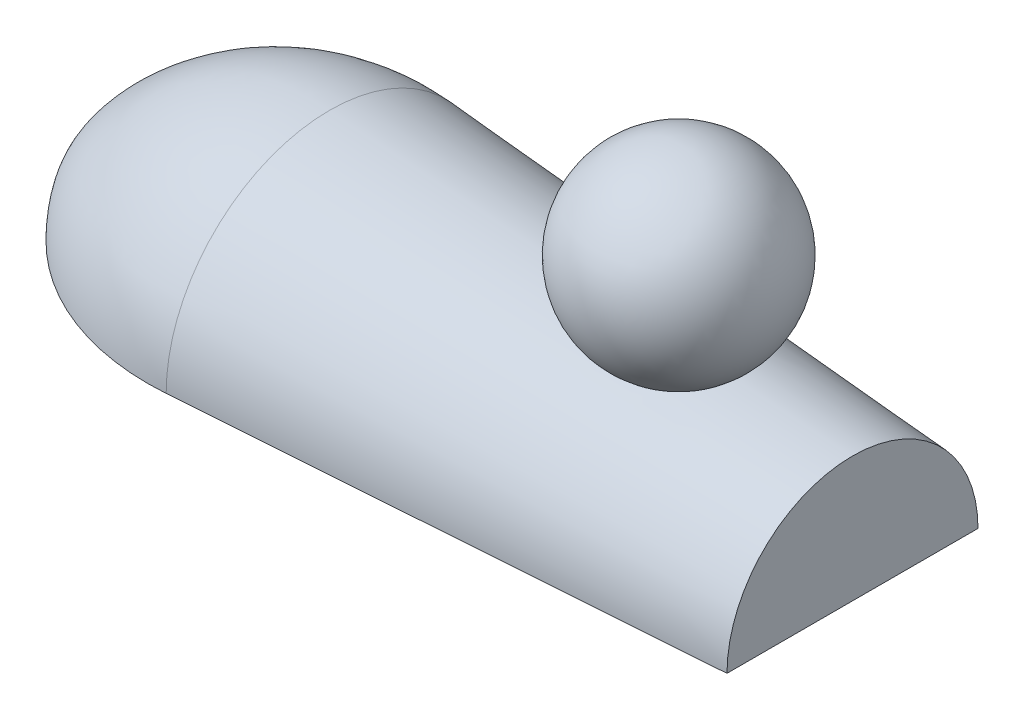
ISO-10303-21;
HEADER;
FILE_DESCRIPTION(('STEP AP214'),'2;1');
FILE_NAME('part.step','',(''),(''),'','','');
FILE_SCHEMA(('AUTOMOTIVE_DESIGN { 1 0 10303 214 1 1 1 1 }'));
ENDSEC;
DATA;
#1=APPLICATION_CONTEXT('core data for automotive mechanical design processes');
#2=APPLICATION_PROTOCOL_DEFINITION('international standard','automotive_design',2000,#1);
#3=PRODUCT_CONTEXT('',#1,'mechanical');
#4=PRODUCT('Part','Part','',(#3));
#5=PRODUCT_RELATED_PRODUCT_CATEGORY('part','',(#4));
#6=PRODUCT_DEFINITION_FORMATION('','',#4);
#7=PRODUCT_DEFINITION_CONTEXT('part definition',#1,'design');
#8=PRODUCT_DEFINITION('design','',#6,#7);
#9=PRODUCT_DEFINITION_SHAPE('','',#8);
#10=(LENGTH_UNIT() NAMED_UNIT(*) SI_UNIT(.MILLI.,.METRE.));
#11=(NAMED_UNIT(*) PLANE_ANGLE_UNIT() SI_UNIT($,.RADIAN.));
#12=(NAMED_UNIT(*) SI_UNIT($,.STERADIAN.) SOLID_ANGLE_UNIT());
#13=UNCERTAINTY_MEASURE_WITH_UNIT(LENGTH_MEASURE(1.E-05),#10,'distance_accuracy_value','');
#14=(GEOMETRIC_REPRESENTATION_CONTEXT(3) GLOBAL_UNCERTAINTY_ASSIGNED_CONTEXT((#13)) GLOBAL_UNIT_ASSIGNED_CONTEXT((#10,
#11,#12)) REPRESENTATION_CONTEXT('',''));
#15=CARTESIAN_POINT('',(0.,0.,0.));
#16=DIRECTION('',(0.,0.,1.));
#17=DIRECTION('',(1.,0.,0.));
#18=AXIS2_PLACEMENT_3D('',#15,#16,#17);
#19=CARTESIAN_POINT('',(0.,0.,0.));
#20=DIRECTION('',(0.,1.,0.));
#21=DIRECTION('',(-1.,0.,0.));
#22=AXIS2_PLACEMENT_3D('',#19,#20,#21);
#23=SPHERICAL_SURFACE('',#22,28.75);
#24=CARTESIAN_POINT('',(16.7923871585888,-23.3362000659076,0.));
#25=CARTESIAN_POINT('',(16.7923858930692,-23.3362005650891,0.331503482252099));
#26=CARTESIAN_POINT('',(16.7782376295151,-23.3393130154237,0.663022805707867));
#27=CARTESIAN_POINT('',(16.7218622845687,-23.3516584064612,1.32355552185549));
#28=CARTESIAN_POINT('',(16.6796334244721,-23.3608917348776,1.65256875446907));
#29=CARTESIAN_POINT('',(16.5677249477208,-23.3851736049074,2.30578147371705));
#30=CARTESIAN_POINT('',(16.498035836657,-23.4002241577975,2.62997925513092));
#31=CARTESIAN_POINT('',(16.3322355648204,-23.4356498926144,3.27122245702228));
#32=CARTESIAN_POINT('',(16.2361245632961,-23.4560250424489,3.58826792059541));
#33=CARTESIAN_POINT('',(16.0192662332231,-23.5013685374,4.21192150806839));
#34=CARTESIAN_POINT('',(15.8986275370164,-23.5263165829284,4.51856892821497));
#35=CARTESIAN_POINT('',(15.6339801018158,-23.580133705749,5.12129605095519));
#36=CARTESIAN_POINT('',(15.4899629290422,-23.6090041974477,5.41737189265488));
#37=CARTESIAN_POINT('',(15.0253374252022,-23.7003026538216,6.28750518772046));
#38=CARTESIAN_POINT('',(14.6720009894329,-23.7674510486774,6.84390310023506));
#39=CARTESIAN_POINT('',(13.8493103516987,-23.9153351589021,7.95954662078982));
#40=CARTESIAN_POINT('',(13.3714654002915,-23.9967528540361,8.51236003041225));
#41=CARTESIAN_POINT('',(12.3430236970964,-24.1583336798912,9.54595360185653));
#42=CARTESIAN_POINT('',(11.7923871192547,-24.238496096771,10.0266940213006));
#43=CARTESIAN_POINT('',(10.8666067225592,-24.3597799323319,10.7365759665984));
#44=CARTESIAN_POINT('',(10.5095522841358,-24.4036742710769,10.9893458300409));
#45=CARTESIAN_POINT('',(9.7777502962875,-24.4870892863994,11.468806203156));
#46=CARTESIAN_POINT('',(9.40300084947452,-24.5266094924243,11.6954939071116));
#47=CARTESIAN_POINT('',(8.6383488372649,-24.6001261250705,12.1230608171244));
#48=CARTESIAN_POINT('',(8.24843900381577,-24.6341198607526,12.3239274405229));
#49=CARTESIAN_POINT('',(7.45595906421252,-24.6955932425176,12.7000867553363));
#50=CARTESIAN_POINT('',(7.05338763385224,-24.7230722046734,12.8753767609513));
#51=CARTESIAN_POINT('',(6.15374624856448,-24.7756019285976,13.2342201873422));
#52=CARTESIAN_POINT('',(5.65428615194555,-24.7989877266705,13.4120435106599));
#53=CARTESIAN_POINT('',(4.64352640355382,-24.8339665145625,13.7315544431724));
#54=CARTESIAN_POINT('',(4.13222540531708,-24.8455581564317,13.873237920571));
#55=CARTESIAN_POINT('',(3.10070725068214,-24.8561312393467,14.1209892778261));
#56=CARTESIAN_POINT('',(2.58048621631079,-24.8551070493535,14.2270412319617));
#57=CARTESIAN_POINT('',(1.53427132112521,-24.8399058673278,14.4037893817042));
#58=CARTESIAN_POINT('',(1.00827723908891,-24.8257283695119,14.474484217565));
#59=CARTESIAN_POINT('',(-0.122350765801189,-24.780964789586,14.5883251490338));
#60=CARTESIAN_POINT('',(-0.727454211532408,-24.7483187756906,14.626072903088));
#61=CARTESIAN_POINT('',(-1.93762735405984,-24.6655336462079,14.6556369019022));
#62=CARTESIAN_POINT('',(-2.54269704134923,-24.6153927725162,14.6474485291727));
#63=CARTESIAN_POINT('',(-3.74932623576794,-24.4980743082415,14.5848588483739));
#64=CARTESIAN_POINT('',(-4.35088228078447,-24.4308821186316,14.5304178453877));
#65=CARTESIAN_POINT('',(-5.54588671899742,-24.2804573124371,14.3747611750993));
#66=CARTESIAN_POINT('',(-6.13933527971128,-24.1972250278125,14.2735464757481));
#67=CARTESIAN_POINT('',(-7.33393130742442,-24.0130875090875,14.0193373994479));
#68=CARTESIAN_POINT('',(-7.93465276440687,-23.9116769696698,13.8646971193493));
#69=CARTESIAN_POINT('',(-9.1179773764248,-23.6954312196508,13.5035519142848));
#70=CARTESIAN_POINT('',(-9.7005778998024,-23.5805940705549,13.2970394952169));
#71=CARTESIAN_POINT('',(-10.8412502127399,-23.3405074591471,12.8313651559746));
#72=CARTESIAN_POINT('',(-11.39935342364,-23.2152719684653,12.5722732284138));
#73=CARTESIAN_POINT('',(-12.4854857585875,-22.9578110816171,12.0002899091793));
#74=CARTESIAN_POINT('',(-13.0135281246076,-22.8255888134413,11.6874224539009));
#75=CARTESIAN_POINT('',(-13.8809571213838,-22.5981895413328,11.1084460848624));
#76=CARTESIAN_POINT('',(-14.2297570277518,-22.5036863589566,10.8560914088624));
#77=CARTESIAN_POINT('',(-14.9063174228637,-22.3150798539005,10.3244978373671));
#78=CARTESIAN_POINT('',(-15.2340826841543,-22.2209764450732,10.0452650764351));
#79=CARTESIAN_POINT('',(-15.86529726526,-22.0351637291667,9.46044239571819));
#80=CARTESIAN_POINT('',(-16.1687719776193,-21.9434519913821,9.15488071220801));
#81=CARTESIAN_POINT('',(-16.7485616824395,-21.7644018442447,8.51777211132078));
#82=CARTESIAN_POINT('',(-17.0248801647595,-21.6770628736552,8.18622854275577));
#83=CARTESIAN_POINT('',(-17.5055270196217,-21.5223114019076,7.55289123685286));
#84=CARTESIAN_POINT('',(-17.7143226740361,-21.4539354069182,7.25471806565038));
#85=CARTESIAN_POINT('',(-18.1081653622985,-21.3232167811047,6.64184991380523));
#86=CARTESIAN_POINT('',(-18.2932168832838,-21.2608730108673,6.32715807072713));
#87=CARTESIAN_POINT('',(-18.6374895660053,-21.1435753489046,5.68265794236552));
#88=CARTESIAN_POINT('',(-18.79671452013,-21.0886203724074,5.3528518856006));
#89=CARTESIAN_POINT('',(-19.0873657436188,-20.987390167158,4.67988451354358));
#90=CARTESIAN_POINT('',(-19.2187916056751,-20.941115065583,4.33672300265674));
#91=CARTESIAN_POINT('',(-19.4526830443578,-20.8581914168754,3.6372992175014));
#92=CARTESIAN_POINT('',(-19.5549790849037,-20.8215993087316,3.28097336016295));
#93=CARTESIAN_POINT('',(-19.7280494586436,-20.7593971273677,2.55978034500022));
#94=CARTESIAN_POINT('',(-19.7988235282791,-20.7337871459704,2.19491311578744));
#95=CARTESIAN_POINT('',(-19.9076842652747,-20.6942957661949,1.45983517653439));
#96=CARTESIAN_POINT('',(-19.9457831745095,-20.680409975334,1.08962652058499));
#97=CARTESIAN_POINT('',(-19.9886931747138,-20.6647660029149,0.347043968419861));
#98=CARTESIAN_POINT('',(-19.9935072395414,-20.6630067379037,-0.0253297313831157));
#99=CARTESIAN_POINT('',(-19.9709627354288,-20.6712305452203,-0.731855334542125));
#100=CARTESIAN_POINT('',(-19.9467556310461,-20.680063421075,-1.06612607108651));
#101=CARTESIAN_POINT('',(-19.8716308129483,-20.7073833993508,-1.73125605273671));
#102=CARTESIAN_POINT('',(-19.8207130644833,-20.7258705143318,-2.06211529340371));
#103=CARTESIAN_POINT('',(-19.6928521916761,-20.7720584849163,-2.71805724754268));
#104=CARTESIAN_POINT('',(-19.6159120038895,-20.7997583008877,-3.04314060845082));
#105=CARTESIAN_POINT('',(-19.4369881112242,-20.8637372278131,-3.6854649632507));
#106=CARTESIAN_POINT('',(-19.3350036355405,-20.9000166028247,-4.00270571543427));
#107=CARTESIAN_POINT('',(-19.1068331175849,-20.980497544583,-4.62850061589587));
#108=CARTESIAN_POINT('',(-18.9805697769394,-21.0247243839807,-4.93702330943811));
#109=CARTESIAN_POINT('',(-18.7054668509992,-21.1201066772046,-5.54275999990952));
#110=CARTESIAN_POINT('',(-18.5566197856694,-21.1712644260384,-5.8399702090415));
#111=CARTESIAN_POINT('',(-18.0784707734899,-21.3336574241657,-6.71247410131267));
#112=CARTESIAN_POINT('',(-17.7174185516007,-21.453863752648,-7.26902558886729));
#113=CARTESIAN_POINT('',(-16.8775491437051,-21.7247302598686,-8.38515863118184));
#114=CARTESIAN_POINT('',(-16.3899186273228,-21.87730640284,-8.93756204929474));
#115=CARTESIAN_POINT('',(-15.3416967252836,-22.1911332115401,-9.96553867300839));
#116=CARTESIAN_POINT('',(-14.7810646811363,-22.3523886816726,-10.4410687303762));
#117=CARTESIAN_POINT('',(-13.8433595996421,-22.6081972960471,-11.1351110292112));
#118=CARTESIAN_POINT('',(-13.4849094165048,-22.7030767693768,-11.3792369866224));
#119=CARTESIAN_POINT('',(-12.7503637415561,-22.8909102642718,-11.8403407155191));
#120=CARTESIAN_POINT('',(-12.3742664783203,-22.9838640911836,-12.0573157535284));
#121=CARTESIAN_POINT('',(-11.6068259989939,-23.1663663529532,-12.4643773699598));
#122=CARTESIAN_POINT('',(-11.2154760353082,-23.2559132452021,-12.6544518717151));
#123=CARTESIAN_POINT('',(-10.4198945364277,-23.4302758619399,-13.007981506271));
#124=CARTESIAN_POINT('',(-10.0156616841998,-23.5150911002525,-13.1714339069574));
#125=CARTESIAN_POINT('',(-9.11745555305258,-23.6946451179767,-13.5010599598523));
#126=CARTESIAN_POINT('',(-8.62119535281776,-23.788148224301,-13.6616925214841));
#127=CARTESIAN_POINT('',(-7.6165314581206,-23.9652405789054,-13.9462788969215));
#128=CARTESIAN_POINT('',(-7.10812645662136,-24.0488287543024,-14.0702287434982));
#129=CARTESIAN_POINT('',(-6.08195995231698,-24.2048582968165,-14.2820781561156));
#130=CARTESIAN_POINT('',(-5.56419458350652,-24.2772949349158,-14.3699624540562));
#131=CARTESIAN_POINT('',(-4.52233237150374,-24.41001502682,-14.5100968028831));
#132=CARTESIAN_POINT('',(-3.99823528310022,-24.4702980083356,-14.5623454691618));
#133=CARTESIAN_POINT('',(-2.87260746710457,-24.585579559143,-14.6364198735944));
#134=CARTESIAN_POINT('',(-2.27052414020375,-24.6386517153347,-14.6529520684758));
#135=CARTESIAN_POINT('',(-1.06551913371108,-24.7275119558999,-14.6404379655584));
#136=CARTESIAN_POINT('',(-0.462597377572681,-24.7632983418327,-14.611387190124));
#137=CARTESIAN_POINT('',(0.740670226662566,-24.8174745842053,-14.5076724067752));
#138=CARTESIAN_POINT('',(1.34101320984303,-24.8358484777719,-14.4329666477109));
#139=CARTESIAN_POINT('',(2.5344717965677,-24.8554600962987,-14.2376536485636));
#140=CARTESIAN_POINT('',(3.12758752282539,-24.8566981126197,-14.1170471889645));
#141=CARTESIAN_POINT('',(4.3257038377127,-24.8425421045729,-13.8236855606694));
#142=CARTESIAN_POINT('',(4.93023756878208,-24.8264839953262,-13.6490454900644));
#143=CARTESIAN_POINT('',(6.1216606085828,-24.7781158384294,-13.2487094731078));
#144=CARTESIAN_POINT('',(6.70854711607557,-24.7458032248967,-13.023005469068));
#145=CARTESIAN_POINT('',(7.85786851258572,-24.6670375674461,-12.519913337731));
#146=CARTESIAN_POINT('',(8.42033539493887,-24.6206037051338,-12.2425955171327));
#147=CARTESIAN_POINT('',(9.51477368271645,-24.516301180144,-11.6351439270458));
#148=CARTESIAN_POINT('',(10.0467592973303,-24.458437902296,-11.3050350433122));
#149=CARTESIAN_POINT('',(10.9140190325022,-24.353852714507,-10.7016344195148));
#150=CARTESIAN_POINT('',(11.2593023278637,-24.3092092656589,-10.4422831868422));
#151=CARTESIAN_POINT('',(11.9287472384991,-24.2174657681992,-9.89797658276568));
#152=CARTESIAN_POINT('',(12.2529115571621,-24.1703660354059,-9.61302449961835));
#153=CARTESIAN_POINT('',(12.8765883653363,-24.0752733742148,-9.01803859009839));
#154=CARTESIAN_POINT('',(13.1761266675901,-24.0272814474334,-8.70803171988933));
#155=CARTESIAN_POINT('',(13.7474317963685,-23.9320293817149,-8.06326830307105));
#156=CARTESIAN_POINT('',(14.0192028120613,-23.8847691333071,-7.72851550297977));
#157=CARTESIAN_POINT('',(14.4883218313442,-23.8004902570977,-7.09350631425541));
#158=CARTESIAN_POINT('',(14.690509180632,-23.763082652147,-6.79687130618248));
#159=CARTESIAN_POINT('',(15.0708338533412,-23.6910954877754,-6.18825240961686));
#160=CARTESIAN_POINT('',(15.2489753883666,-23.6565154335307,-5.87627122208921));
#161=CARTESIAN_POINT('',(15.5788901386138,-23.591273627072,-5.23854483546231));
#162=CARTESIAN_POINT('',(15.7306832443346,-23.5606089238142,-4.91281025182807));
#163=CARTESIAN_POINT('',(16.0059357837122,-23.504189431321,-4.2491637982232));
#164=CARTESIAN_POINT('',(16.1293989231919,-23.4784339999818,-3.91125352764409));
#165=CARTESIAN_POINT('',(16.3286757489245,-23.4364167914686,-3.28065211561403));
#166=CARTESIAN_POINT('',(16.4089588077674,-23.4192944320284,-2.98942442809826));
#167=CARTESIAN_POINT('',(16.5473081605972,-23.3895955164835,-2.40152069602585));
#168=CARTESIAN_POINT('',(16.6053768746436,-23.3770184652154,-2.10484524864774));
#169=CARTESIAN_POINT('',(16.6985899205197,-23.3567511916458,-1.50771192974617));
#170=CARTESIAN_POINT('',(16.7337320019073,-23.3490614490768,-1.20725368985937));
#171=CARTESIAN_POINT('',(16.7806272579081,-23.3387865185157,-0.604534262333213));
#172=CARTESIAN_POINT('',(16.7923883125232,-23.3361996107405,-0.302273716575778));
#173=CARTESIAN_POINT('',(16.7923871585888,-23.3362000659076,0.));
#174=B_SPLINE_CURVE_WITH_KNOTS('',3,(#24,#25,#26,#27,#28,#29,#30,#31,#32,#33,#34,#35,#36,#37,
#38,#39,#40,#41,#42,#43,#44,#45,#46,#47,#48,#49,#50,#51,#52,#53,#54,#55,#56,#57,#58,#59,#60,#61,
#62,#63,#64,#65,#66,#67,#68,#69,#70,#71,#72,#73,#74,#75,#76,#77,#78,#79,#80,#81,#82,#83,#84,#85,
#86,#87,#88,#89,#90,#91,#92,#93,#94,#95,#96,#97,#98,#99,#100,#101,#102,#103,#104,#105,#106,#107,
#108,#109,#110,#111,#112,#113,#114,#115,#116,#117,#118,#119,#120,#121,#122,#123,#124,#125,#126,
#127,#128,#129,#130,#131,#132,#133,#134,#135,#136,#137,#138,#139,#140,#141,#142,#143,#144,#145,
#146,#147,#148,#149,#150,#151,#152,#153,#154,#155,#156,#157,#158,#159,#160,#161,#162,#163,#164,
#165,#166,#167,#168,#169,#170,#171,#172,#173),.UNSPECIFIED.,.T.,.F.,(4,2,2,2,2,2,2,2,2,2,2,2,2,
2,2,2,2,2,2,2,2,2,2,2,2,2,2,2,2,2,2,2,2,2,2,2,2,2,2,2,2,2,2,2,2,2,2,2,2,2,2,2,2,2,2,2,2,2,2,2,2,
2,2,2,2,2,2,2,2,2,2,2,2,2,4),(0.,0.994223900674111,1.98851078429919,2.98314174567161,
3.97776671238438,4.96807889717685,5.95874913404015,7.9387171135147,10.1366972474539,
12.3358849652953,13.653867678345,14.9719920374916,16.2907563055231,17.6096589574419,
19.2001267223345,20.790776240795,22.3821357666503,23.9735564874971,25.7929910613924,
27.6126085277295,29.4337892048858,31.2549321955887,33.1380913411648,35.0215227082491,
36.9024631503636,38.7825685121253,40.1036909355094,41.4245125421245,42.7439348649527,
44.0631874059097,45.1732195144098,46.2830415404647,47.3927004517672,48.5023756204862,
49.618382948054,50.734399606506,51.8499979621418,52.9654966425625,53.9700765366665,
54.9746577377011,55.979125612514,56.983624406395,57.991375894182,58.9994618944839,
61.0144070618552,63.2637348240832,65.5143207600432,66.8451097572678,68.1760326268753,
69.5075511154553,70.8392061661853,72.4273816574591,74.0157288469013,75.6047477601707,
77.1938284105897,79.005742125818,80.8178338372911,82.6315851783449,84.4453056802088,
86.3312305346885,88.2174531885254,90.1011250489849,91.9839115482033,93.2852000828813,
94.5863217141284,95.8860616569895,97.1856052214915,98.2673477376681,99.3489005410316,
100.429633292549,101.510224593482,102.417099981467,103.323876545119,104.230742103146,
105.137301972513),.UNSPECIFIED.);
#175=CARTESIAN_POINT('',(16.7923871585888,-23.3362000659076,0.));
#176=VERTEX_POINT('',#175);
#177=EDGE_CURVE('E11',#176,#176,#174,.T.);
#178=ORIENTED_EDGE('',*,*,#177,.F.);
#179=EDGE_LOOP('',(#178));
#180=FACE_BOUND('',#179,.T.);
#181=ADVANCED_FACE('F35',(#180),#23,.T.);
#182=CARTESIAN_POINT('',(-103.951908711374,-63.25,0.));
#183=DIRECTION('',(-1.,0.,0.));
#184=DIRECTION('',(0.,0.,1.));
#185=AXIS2_PLACEMENT_3D('',#182,#183,#184);
#186=CONICAL_SURFACE('',#185,48.6828658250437,0.0724978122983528);
#187=CARTESIAN_POINT('',(-103.951908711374,-63.25,0.));
#188=DIRECTION('',(1.,0.,0.));
#189=DIRECTION('',(0.,0.,-1.));
#190=AXIS2_PLACEMENT_3D('',#187,#188,#189);
#191=CIRCLE('',#190,48.6828658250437);
#192=CARTESIAN_POINT('',(-103.951908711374,-63.2500000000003,-48.6828658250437));
#193=VERTEX_POINT('',#192);
#194=CARTESIAN_POINT('',(-103.951908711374,-63.25,48.6828658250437));
#195=VERTEX_POINT('',#194);
#196=EDGE_CURVE('E59',#193,#195,#191,.T.);
#197=ORIENTED_EDGE('',*,*,#196,.T.);
#198=DIRECTION('',(0.997373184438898,0.,-0.0724343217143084));
#199=VECTOR('',#198,1.);
#200=CARTESIAN_POINT('',(51.75,-63.25,37.375));
#201=LINE('',#200,#199);
#202=CARTESIAN_POINT('',(51.75,-63.25,37.375));
#203=VERTEX_POINT('',#202);
#204=EDGE_CURVE('E71',#195,#203,#201,.T.);
#205=ORIENTED_EDGE('',*,*,#204,.T.);
#206=CARTESIAN_POINT('',(51.75,-63.25,0.));
#207=DIRECTION('',(1.,0.,0.));
#208=DIRECTION('',(0.,0.,-1.));
#209=AXIS2_PLACEMENT_3D('',#206,#207,#208);
#210=CIRCLE('',#209,37.375);
#211=CARTESIAN_POINT('',(51.75,-63.2500000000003,-37.375));
#212=VERTEX_POINT('',#211);
#213=EDGE_CURVE('E45',#212,#203,#210,.T.);
#214=ORIENTED_EDGE('',*,*,#213,.F.);
#215=DIRECTION('',(0.997373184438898,0.,0.0724343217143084));
#216=VECTOR('',#215,1.);
#217=CARTESIAN_POINT('',(51.75,-63.2500000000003,-37.375));
#218=LINE('',#217,#216);
#219=EDGE_CURVE('E72',#193,#212,#218,.T.);
#220=ORIENTED_EDGE('',*,*,#219,.F.);
#221=EDGE_LOOP('',(#197,#205,#214,#220));
#222=FACE_BOUND('',#221,.T.);
#223=ORIENTED_EDGE('',*,*,#177,.T.);
#224=EDGE_LOOP('',(#223));
#225=FACE_BOUND('',#224,.T.);
#226=ADVANCED_FACE('F68',(#222,#225),#186,.T.);
#227=CARTESIAN_POINT('',(51.75,-63.25,0.));
#228=DIRECTION('',(-1.,0.,0.));
#229=DIRECTION('',(0.,0.,1.));
#230=AXIS2_PLACEMENT_3D('',#227,#228,#229);
#231=PLANE('',#230);
#232=ORIENTED_EDGE('',*,*,#213,.T.);
#233=DIRECTION('',(0.,0.,1.));
#234=VECTOR('',#233,1.);
#235=CARTESIAN_POINT('',(51.75,-63.25,0.));
#236=LINE('',#235,#234);
#237=EDGE_CURVE('E81',#212,#203,#236,.T.);
#238=ORIENTED_EDGE('',*,*,#237,.F.);
#239=EDGE_LOOP('',(#232,#238));
#240=FACE_BOUND('',#239,.T.);
#241=ADVANCED_FACE('F87',(#240),#231,.F.);
#242=CARTESIAN_POINT('',(-109.25,-63.25,24.2683823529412));
#243=DIRECTION('',(0.,-1.,0.));
#244=DIRECTION('',(0.,0.,-1.));
#245=AXIS2_PLACEMENT_3D('',#242,#243,#244);
#246=CIRCLE('',#245,73.1433823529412);
#247=TRIMMED_CURVE('',#246,(PARAMETER_VALUE(-1.23259387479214)),
(PARAMETER_VALUE(1.23259387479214)),.T.,.PARAMETER.);
#248=CARTESIAN_POINT('',(-109.25,-63.25,0.));
#249=DIRECTION('',(1.,0.,0.));
#250=AXIS1_PLACEMENT('',#248,#249);
#251=SURFACE_OF_REVOLUTION('',#247,#250);
#252=CARTESIAN_POINT('',(-109.25,-63.25,-24.2683823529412));
#253=DIRECTION('',(0.,1.,0.));
#254=DIRECTION('',(0.,0.,-1.));
#255=AXIS2_PLACEMENT_3D('',#252,#253,#254);
#256=CIRCLE('',#255,73.1433823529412);
#257=CARTESIAN_POINT('',(-178.25,-63.25,0.));
#258=VERTEX_POINT('',#257);
#259=EDGE_CURVE('E74',#258,#195,#256,.T.);
#260=ORIENTED_EDGE('',*,*,#259,.T.);
#261=ORIENTED_EDGE('',*,*,#196,.F.);
#262=CARTESIAN_POINT('',(-109.25,-63.2499999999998,24.2683823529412));
#263=DIRECTION('',(0.,-1.,0.));
#264=DIRECTION('',(0.,0.,1.));
#265=AXIS2_PLACEMENT_3D('',#262,#263,#264);
#266=CIRCLE('',#265,73.1433823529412);
#267=EDGE_CURVE('E76',#258,#193,#266,.T.);
#268=ORIENTED_EDGE('',*,*,#267,.F.);
#269=EDGE_LOOP('',(#260,#261,#268));
#270=FACE_BOUND('',#269,.T.);
#271=ADVANCED_FACE('F75',(#270),#251,.T.);
#272=CARTESIAN_POINT('',(-109.25,-63.2499999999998,24.2683823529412));
#273=DIRECTION('',(0.,1.,0.));
#274=DIRECTION('',(0.,0.,1.));
#275=AXIS2_PLACEMENT_3D('',#272,#273,#274);
#276=PLANE('',#275);
#277=ORIENTED_EDGE('',*,*,#237,.T.);
#278=ORIENTED_EDGE('',*,*,#204,.F.);
#279=ORIENTED_EDGE('',*,*,#259,.F.);
#280=ORIENTED_EDGE('',*,*,#267,.T.);
#281=ORIENTED_EDGE('',*,*,#219,.T.);
#282=EDGE_LOOP('',(#277,#278,#279,#280,#281));
#283=FACE_BOUND('',#282,.T.);
#284=ADVANCED_FACE('F79',(#283),#276,.F.);
#285=CLOSED_SHELL('',(#181,#226,#241,#271,#284));
#286=MANIFOLD_SOLID_BREP('B2',#285);
#287=ADVANCED_BREP_SHAPE_REPRESENTATION('',(#18,#286),#14);
#288=SHAPE_DEFINITION_REPRESENTATION(#9,#287);
ENDSEC;
END-ISO-10303-21;
